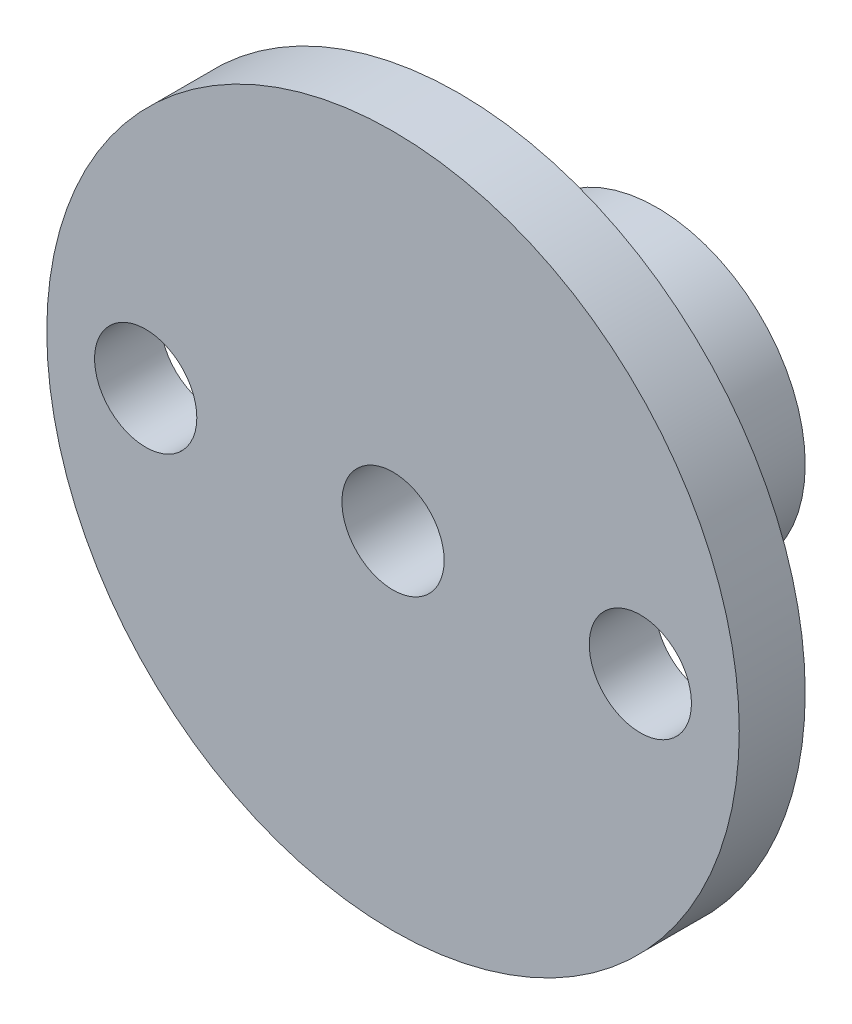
from build123d import *

# Parameters (mm, degrees)
ESQUISSE1_R             = 4.5
EXTRUSION1_DEPTH        = 6
ESQUISSE2_R             = 10.5
EXTRUSION2_DEPTH        = 2
ESQUISSE3_R             = 1.55
ENL_V_MAT_EXTRU_1_DEPTH = 17.867127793
ESQUISSE4_R             = 1.55
ENL_V_MAT_EXTRU_2_DEPTH = 17.867127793
ESQUISSE5_R             = 1.5
ENL_V_MAT_EXTRU_3_DEPTH = 10


with BuildPart() as part:
    # Esquisse1 → Extrusion1 (new body)
    with BuildSketch(Plane.XY):
        Circle(ESQUISSE1_R)
    extrude(amount=EXTRUSION1_DEPTH)

    # Esquisse2 → Extrusion2 (add)
    with BuildSketch(Plane.XY.offset(6)):
        Circle(ESQUISSE2_R)
    extrude(amount=EXTRUSION2_DEPTH)

    # Esquisse3 → Enl_v. mat.-Extru.1 (cut, through all)
    with BuildSketch(Plane.XY.offset(8)):
        Circle(ESQUISSE3_R)
    extrude(amount=-ENL_V_MAT_EXTRU_1_DEPTH, mode=Mode.SUBTRACT)

    # Esquisse4 → Enl_v. mat.-Extru.2 (cut, through all)
    with BuildSketch(Plane.XY.offset(8)):
        with Locations((-7.5, 0)):
            Circle(ESQUISSE4_R)
        with Locations((7.5, 0)):
            Circle(ESQUISSE4_R)
    extrude(amount=-ENL_V_MAT_EXTRU_2_DEPTH, mode=Mode.SUBTRACT)

    # Esquisse5 → Enl_v. mat.-Extru.3 (cut)
    with BuildSketch(Plane(origin=(0, 0, 0), x_dir=(1, 0, 0), z_dir=(0, 1, 0))):
        with Locations(Location((0, -3, 0), (0, 0, 270))):
            Circle(ESQUISSE5_R)
    extrude(amount=-ENL_V_MAT_EXTRU_3_DEPTH, mode=Mode.SUBTRACT)


solid = part.part
